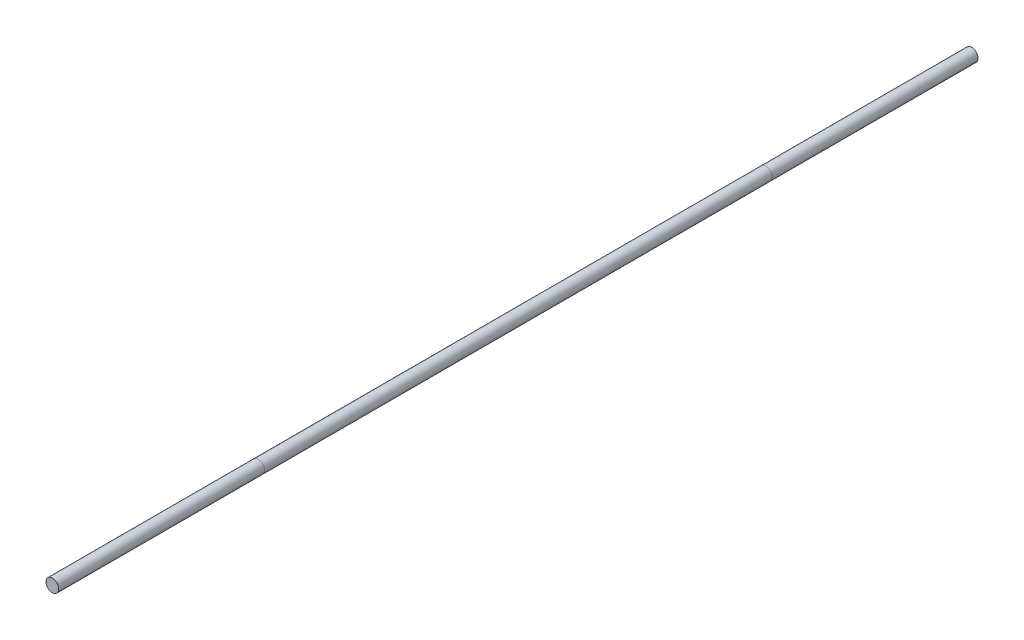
from build123d import *

# Parameters (mm, degrees)
SKETCH1_R          = 3.175
BASE_EXTRUDE_DEPTH = 230


with BuildPart() as part:
    # Sketch1 → Base-Extrude (new, symmetric)
    with BuildSketch(Plane.XY):
        Circle(SKETCH1_R)
    extrude(amount=BASE_EXTRUDE_DEPTH, both=True)


solid = part.part
